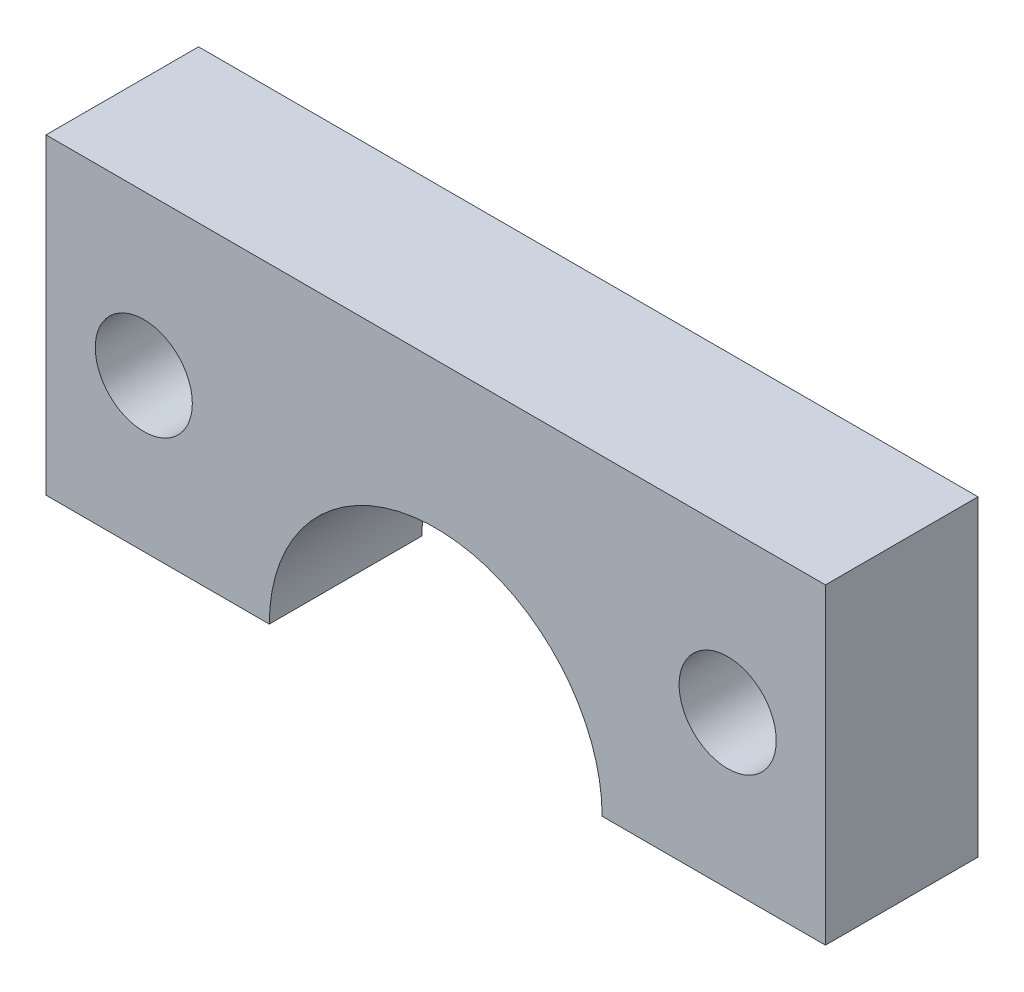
from build123d import *

# Parameters (mm, degrees)
SKETCH1_R           = 1.75
BOSS_EXTRUDE2_DEPTH = 5.5


with BuildPart() as part:
    # Sketch1 → Boss-Extrude2 (new body)
    with BuildSketch(Plane.XY):
        with BuildLine():
            Line((-22.6, 16.75), (-14.55, 16.75))
            ThreePointArc((-14.55, 16.75), (-8.55, 22.75), (-2.55, 16.75))
            Line((-2.55, 16.75), (5.5, 16.75))
            Line((5.5, 16.75), (5.5, 28))
            Line((5.5, 28), (2.75, 28))
            Line((2.75, 28), (-19.85, 28))
            Line((-19.85, 28), (-22.6, 28))
            Line((-22.6, 28), (-22.6, 16.75))
        make_face()
        with Locations((1.975, 22.25)):
            Circle(SKETCH1_R, mode=Mode.SUBTRACT)
        with Locations((-19.075, 22.25)):
            Circle(SKETCH1_R, mode=Mode.SUBTRACT)
    extrude(amount=BOSS_EXTRUDE2_DEPTH)


solid = part.part
